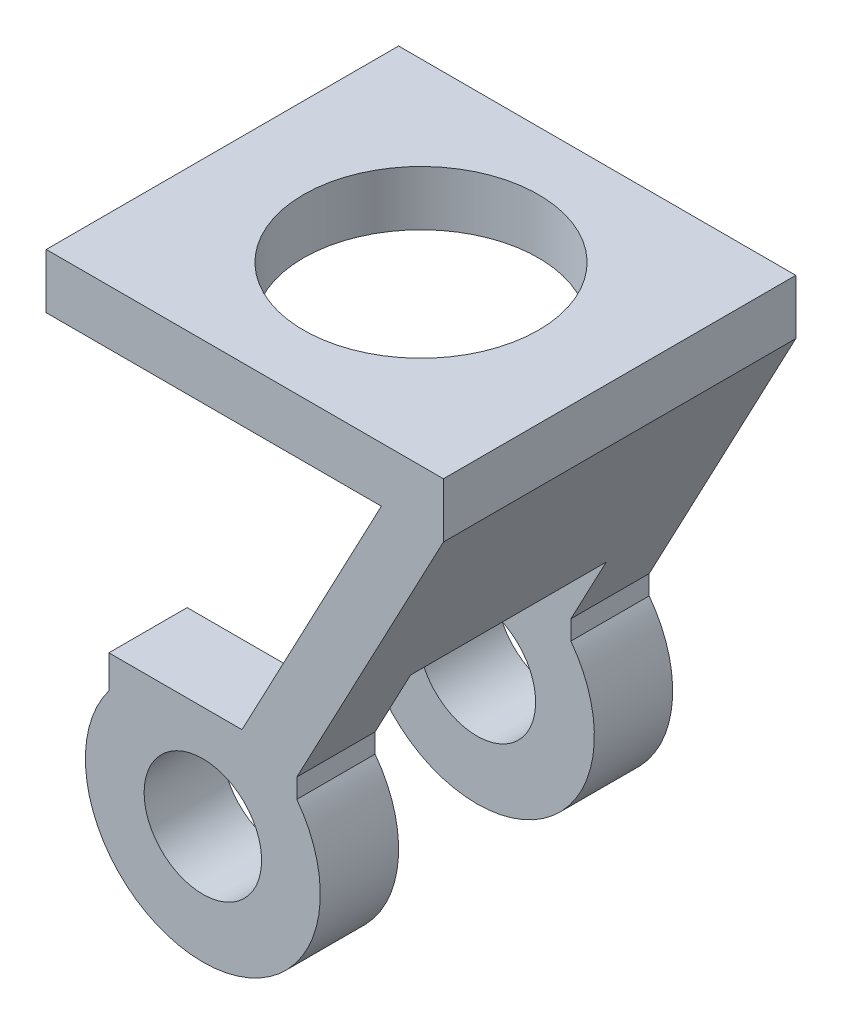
from build123d import *

# Parameters (mm, degrees)
SKETCH1_R           = 7.5
BOSS_EXTRUDE1_DEPTH = 45
SKETCH2_W           = 25
SKETCH2_H           = 35.011076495
CUT_EXTRUDE1_DEPTH  = 61
SKETCH3_R           = 15
CUT_EXTRUDE2_DEPTH  = 7


with BuildPart() as part:
    # Sketch1 → Boss-Extrude1 (new body)
    with BuildSketch(Plane.XY):
        with BuildLine():
            Line((12, 9), (12, 11.469383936))
            Line((12, 11.469383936), (30.721294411, 46.817837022))
            Line((30.721294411, 46.817837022), (30.721294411, 53.817837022))
            Line((30.721294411, 53.817837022), (-20, 53.817837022))
            Line((-20, 53.817837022), (-20, 46.817837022))
            Line((-20, 46.817837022), (22.800155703, 46.817837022))
            Line((22.800155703, 46.817837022), (5, 13.208624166))
            Line((5, 13.208624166), (-12, 13.208624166))
            Line((-12, 13.208624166), (-12, 9))
            ThreePointArc((-12, 9), (0, -15), (12, 9))
        make_face()
        with Locations(Location((0, 0, 0), (0, 0, 180))):
            Circle(SKETCH1_R, mode=Mode.SUBTRACT)
    extrude(amount=BOSS_EXTRUDE1_DEPTH)

    # Sketch2 → Cut-Extrude1 (cut)
    with BuildSketch(Plane(origin=(30.721294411, 0, 0), x_dir=(0, 0, -1), z_dir=(1, 0, 0))):
        with Locations((-22.5, 2.505538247)):
            Rectangle(SKETCH2_W, SKETCH2_H)
    extrude(amount=-CUT_EXTRUDE1_DEPTH, mode=Mode.SUBTRACT)

    # Sketch3 → Cut-Extrude2 (cut)
    with BuildSketch(Plane(origin=(0, 53.817837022, 0), x_dir=(1, 0, 0), z_dir=(0, 1, 0))):
        with Locations(Location((5.360647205, -22.5, 0), (0, 0, 180))):
            Circle(SKETCH3_R)
    extrude(amount=-CUT_EXTRUDE2_DEPTH, mode=Mode.SUBTRACT)


solid = part.part
